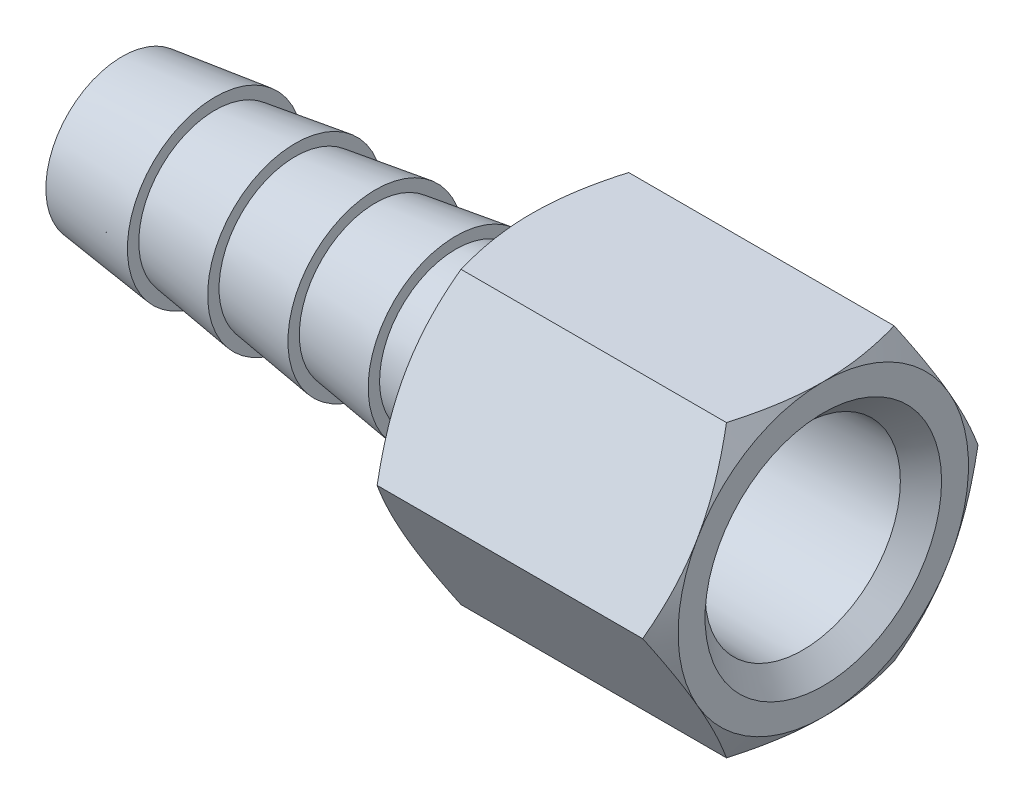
ISO-10303-21;
HEADER;
FILE_DESCRIPTION(('STEP AP214'),'2;1');
FILE_NAME('part.step','',(''),(''),'','','');
FILE_SCHEMA(('AUTOMOTIVE_DESIGN { 1 0 10303 214 1 1 1 1 }'));
ENDSEC;
DATA;
#1=APPLICATION_CONTEXT('core data for automotive mechanical design processes');
#2=APPLICATION_PROTOCOL_DEFINITION('international standard','automotive_design',2000,#1);
#3=PRODUCT_CONTEXT('',#1,'mechanical');
#4=PRODUCT('Part','Part','',(#3));
#5=PRODUCT_RELATED_PRODUCT_CATEGORY('part','',(#4));
#6=PRODUCT_DEFINITION_FORMATION('','',#4);
#7=PRODUCT_DEFINITION_CONTEXT('part definition',#1,'design');
#8=PRODUCT_DEFINITION('design','',#6,#7);
#9=PRODUCT_DEFINITION_SHAPE('','',#8);
#10=(LENGTH_UNIT() NAMED_UNIT(*) SI_UNIT(.MILLI.,.METRE.));
#11=(NAMED_UNIT(*) PLANE_ANGLE_UNIT() SI_UNIT($,.RADIAN.));
#12=(NAMED_UNIT(*) SI_UNIT($,.STERADIAN.) SOLID_ANGLE_UNIT());
#13=UNCERTAINTY_MEASURE_WITH_UNIT(LENGTH_MEASURE(1.E-05),#10,'distance_accuracy_value','');
#14=(GEOMETRIC_REPRESENTATION_CONTEXT(3) GLOBAL_UNCERTAINTY_ASSIGNED_CONTEXT((#13)) GLOBAL_UNIT_ASSIGNED_CONTEXT((#10,
#11,#12)) REPRESENTATION_CONTEXT('',''));
#15=CARTESIAN_POINT('',(0.,0.,0.));
#16=DIRECTION('',(0.,0.,1.));
#17=DIRECTION('',(1.,0.,0.));
#18=AXIS2_PLACEMENT_3D('',#15,#16,#17);
#19=CARTESIAN_POINT('',(24.6379999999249,0.,0.));
#20=DIRECTION('',(1.,0.,0.));
#21=DIRECTION('',(0.,1.,0.));
#22=AXIS2_PLACEMENT_3D('',#19,#20,#21);
#23=CONICAL_SURFACE('',#22,5.27049999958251,0.148889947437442);
#24=CARTESIAN_POINT('',(20.0659999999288,0.,0.));
#25=DIRECTION('',(1.,0.,0.));
#26=DIRECTION('',(0.,1.,0.));
#27=AXIS2_PLACEMENT_3D('',#24,#25,#26);
#28=CIRCLE('',#27,4.58470000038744);
#29=CARTESIAN_POINT('',(20.0659999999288,4.58470000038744,0.));
#30=VERTEX_POINT('',#29);
#31=EDGE_CURVE('E133',#30,#30,#28,.F.);
#32=ORIENTED_EDGE('',*,*,#31,.F.);
#33=EDGE_LOOP('',(#32));
#34=FACE_BOUND('',#33,.T.);
#35=CARTESIAN_POINT('',(24.6380000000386,0.,0.));
#36=DIRECTION('',(1.,0.,0.));
#37=DIRECTION('',(0.,1.,0.));
#38=AXIS2_PLACEMENT_3D('',#35,#36,#37);
#39=CIRCLE('',#38,5.27049999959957);
#40=CARTESIAN_POINT('',(24.6380000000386,5.27049999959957,0.));
#41=VERTEX_POINT('',#40);
#42=EDGE_CURVE('E20',#41,#41,#39,.F.);
#43=ORIENTED_EDGE('',*,*,#42,.T.);
#44=EDGE_LOOP('',(#43));
#45=FACE_BOUND('',#44,.T.);
#46=ADVANCED_FACE('F16',(#34,#45),#23,.T.);
#47=CARTESIAN_POINT('',(24.638,0.,0.));
#48=DIRECTION('',(1.,0.,0.));
#49=DIRECTION('',(0.,0.,-1.));
#50=AXIS2_PLACEMENT_3D('',#47,#48,#49);
#51=PLANE('',#50);
#52=ORIENTED_EDGE('',*,*,#42,.F.);
#53=EDGE_LOOP('',(#52));
#54=FACE_BOUND('',#53,.T.);
#55=CARTESIAN_POINT('',(24.6379999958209,0.,0.));
#56=DIRECTION('',(1.,0.,0.));
#57=DIRECTION('',(0.,0.,-1.));
#58=AXIS2_PLACEMENT_3D('',#55,#56,#57);
#59=CIRCLE('',#58,8.73125000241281);
#60=CARTESIAN_POINT('',(24.6379999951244,4.36562500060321,7.56148430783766));
#61=VERTEX_POINT('',#60);
#62=CARTESIAN_POINT('',(24.6379999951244,-4.3656250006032,7.56148430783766));
#63=VERTEX_POINT('',#62);
#64=EDGE_CURVE('E125',#61,#63,#59,.T.);
#65=ORIENTED_EDGE('',*,*,#64,.F.);
#66=CARTESIAN_POINT('',(24.6379999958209,0.,0.));
#67=DIRECTION('',(1.,0.,0.));
#68=DIRECTION('',(0.,0.,-1.));
#69=AXIS2_PLACEMENT_3D('',#66,#67,#68);
#70=CIRCLE('',#69,8.73125000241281);
#71=CARTESIAN_POINT('',(24.6379999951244,8.73125000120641,0.));
#72=VERTEX_POINT('',#71);
#73=EDGE_CURVE('E103',#72,#61,#70,.T.);
#74=ORIENTED_EDGE('',*,*,#73,.F.);
#75=CARTESIAN_POINT('',(24.6379999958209,0.,0.));
#76=DIRECTION('',(1.,0.,0.));
#77=DIRECTION('',(0.,0.,-1.));
#78=AXIS2_PLACEMENT_3D('',#75,#76,#77);
#79=CIRCLE('',#78,8.73125000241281);
#80=CARTESIAN_POINT('',(24.6379999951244,4.3656250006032,-7.56148430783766));
#81=VERTEX_POINT('',#80);
#82=EDGE_CURVE('E113',#81,#72,#79,.T.);
#83=ORIENTED_EDGE('',*,*,#82,.F.);
#84=CARTESIAN_POINT('',(24.6379999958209,0.,0.));
#85=DIRECTION('',(1.,0.,0.));
#86=DIRECTION('',(0.,0.,-1.));
#87=AXIS2_PLACEMENT_3D('',#84,#85,#86);
#88=CIRCLE('',#87,8.73125000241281);
#89=CARTESIAN_POINT('',(24.6379999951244,-4.3656250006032,-7.56148430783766));
#90=VERTEX_POINT('',#89);
#91=EDGE_CURVE('E469',#90,#81,#88,.T.);
#92=ORIENTED_EDGE('',*,*,#91,.F.);
#93=CARTESIAN_POINT('',(24.6379999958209,0.,0.));
#94=DIRECTION('',(1.,0.,0.));
#95=DIRECTION('',(0.,0.,-1.));
#96=AXIS2_PLACEMENT_3D('',#93,#94,#95);
#97=CIRCLE('',#96,8.73125000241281);
#98=CARTESIAN_POINT('',(24.6379999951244,-8.73125000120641,0.));
#99=VERTEX_POINT('',#98);
#100=EDGE_CURVE('E448',#99,#90,#97,.T.);
#101=ORIENTED_EDGE('',*,*,#100,.F.);
#102=CARTESIAN_POINT('',(24.6379999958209,0.,0.));
#103=DIRECTION('',(1.,0.,0.));
#104=DIRECTION('',(0.,0.,-1.));
#105=AXIS2_PLACEMENT_3D('',#102,#103,#104);
#106=CIRCLE('',#105,8.73125000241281);
#107=EDGE_CURVE('E128',#63,#99,#106,.T.);
#108=ORIENTED_EDGE('',*,*,#107,.F.);
#109=EDGE_LOOP('',(#65,#74,#83,#92,#101,#108));
#110=FACE_BOUND('',#109,.T.);
#111=ADVANCED_FACE('F126',(#54,#110),#51,.F.);
#112=CARTESIAN_POINT('',(20.066,0.,2.63525));
#113=DIRECTION('',(1.,0.,0.));
#114=DIRECTION('',(0.,0.,-1.));
#115=AXIS2_PLACEMENT_3D('',#112,#113,#114);
#116=PLANE('',#115);
#117=ORIENTED_EDGE('',*,*,#31,.T.);
#118=EDGE_LOOP('',(#117));
#119=FACE_BOUND('',#118,.T.);
#120=CARTESIAN_POINT('',(20.0660000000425,0.,0.));
#121=DIRECTION('',(1.,0.,0.));
#122=DIRECTION('',(0.,0.,-1.));
#123=AXIS2_PLACEMENT_3D('',#120,#121,#122);
#124=CIRCLE('',#123,5.27049999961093);
#125=CARTESIAN_POINT('',(20.0660000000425,0.,-5.27049999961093));
#126=VERTEX_POINT('',#125);
#127=EDGE_CURVE('E112',#126,#126,#124,.F.);
#128=ORIENTED_EDGE('',*,*,#127,.F.);
#129=EDGE_LOOP('',(#128));
#130=FACE_BOUND('',#129,.T.);
#131=ADVANCED_FACE('F163',(#119,#130),#116,.T.);
#132=CARTESIAN_POINT('',(25.4225228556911,0.,0.));
#133=DIRECTION('',(1.,0.,0.));
#134=DIRECTION('',(0.,0.,-1.));
#135=AXIS2_PLACEMENT_3D('',#132,#133,#134);
#136=CONICAL_SURFACE('',#135,10.0900834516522,1.04719755);
#137=ORIENTED_EDGE('',*,*,#64,.T.);
#138=CARTESIAN_POINT('',(25.4178437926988,1.0089125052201E-09,10.0819790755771));
#139=CARTESIAN_POINT('',(25.2993607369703,-0.355360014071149,9.87681187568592));
#140=CARTESIAN_POINT('',(25.1908095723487,-0.713565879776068,9.67000162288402));
#141=CARTESIAN_POINT('',(24.9993815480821,-1.43313516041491,9.25455810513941));
#142=CARTESIAN_POINT('',(24.9163777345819,-1.79447347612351,9.04593933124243));
#143=CARTESIAN_POINT('',(24.8144631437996,-2.33989110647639,8.73104231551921));
#144=CARTESIAN_POINT('',(24.784244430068,-2.52238596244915,8.62567886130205));
#145=CARTESIAN_POINT('',(24.7319352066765,-2.88824935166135,8.41444753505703));
#146=CARTESIAN_POINT('',(24.7098444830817,-3.07161786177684,8.30857967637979));
#147=CARTESIAN_POINT('',(24.6741793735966,-3.43990681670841,8.09594794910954));
#148=CARTESIAN_POINT('',(24.6606482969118,-3.62483043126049,7.98918225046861));
#149=CARTESIAN_POINT('',(24.6425398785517,-3.99504134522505,7.77544087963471));
#150=CARTESIAN_POINT('',(24.6379643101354,-4.18032870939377,7.6684651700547));
#151=CARTESIAN_POINT('',(24.6379999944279,-4.36562499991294,7.56148430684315));
#152=B_SPLINE_CURVE_WITH_KNOTS('',3,(#138,#139,#140,#141,#142,#143,#144,#145,#146,#147,#148,
#149,#150,#151),.UNSPECIFIED.,.F.,.F.,(4,2,2,2,2,2,4),(0.,1.2818115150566,2.5571463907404,
3.19565058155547,3.83413796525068,4.47583059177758,5.11765026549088),.UNSPECIFIED.);
#153=CARTESIAN_POINT('',(25.4178437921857,-3.94277984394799E-10,10.0819790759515));
#154=VERTEX_POINT('',#153);
#155=EDGE_CURVE('E136',#154,#63,#152,.T.);
#156=ORIENTED_EDGE('',*,*,#155,.F.);
#157=CARTESIAN_POINT('',(24.6379999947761,4.3656249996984,7.5614843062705));
#158=CARTESIAN_POINT('',(24.6379643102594,4.18032870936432,7.66846516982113));
#159=CARTESIAN_POINT('',(24.6425398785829,3.99504134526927,7.77544087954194));
#160=CARTESIAN_POINT('',(24.6606482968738,3.62483043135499,7.98918225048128));
#161=CARTESIAN_POINT('',(24.6741793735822,3.43990681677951,8.0959479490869));
#162=CARTESIAN_POINT('',(24.7098444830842,3.07161786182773,8.30857967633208));
#163=CARTESIAN_POINT('',(24.7319352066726,2.88824935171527,8.41444753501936));
#164=CARTESIAN_POINT('',(24.7842444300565,2.52238596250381,8.62567886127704));
#165=CARTESIAN_POINT('',(24.8144631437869,2.33989110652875,8.73104231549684));
#166=CARTESIAN_POINT('',(24.9163777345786,1.79447347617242,9.04593933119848));
#167=CARTESIAN_POINT('',(24.9993815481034,1.4331351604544,9.25455810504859));
#168=CARTESIAN_POINT('',(25.1908095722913,0.713565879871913,9.67000162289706));
#169=CARTESIAN_POINT('',(25.2993607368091,0.355360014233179,9.87681187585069));
#170=CARTESIAN_POINT('',(25.4178437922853,-6.93149742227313E-10,10.081979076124));
#171=B_SPLINE_CURVE_WITH_KNOTS('',3,(#157,#158,#159,#160,#161,#162,#163,#164,#165,#166,#167,
#168,#169,#170),.UNSPECIFIED.,.F.,.F.,(4,2,2,2,2,2,4),(0.,0.641819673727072,1.28351230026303,
1.92199968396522,2.56050387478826,3.83583875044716,5.11765026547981),.UNSPECIFIED.);
#172=EDGE_CURVE('E118',#61,#154,#171,.T.);
#173=ORIENTED_EDGE('',*,*,#172,.F.);
#174=EDGE_LOOP('',(#137,#156,#173));
#175=FACE_BOUND('',#174,.T.);
#176=ADVANCED_FACE('F135',(#175),#136,.T.);
#177=CARTESIAN_POINT('',(25.4225228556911,0.,0.));
#178=DIRECTION('',(1.,0.,0.));
#179=DIRECTION('',(0.,0.,-1.));
#180=AXIS2_PLACEMENT_3D('',#177,#178,#179);
#181=CONICAL_SURFACE('',#180,10.0900834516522,1.04719755);
#182=ORIENTED_EDGE('',*,*,#107,.T.);
#183=CARTESIAN_POINT('',(25.4178437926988,-8.73124999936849,5.04098953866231));
#184=CARTESIAN_POINT('',(25.2993607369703,-8.73124999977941,4.63065513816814));
#185=CARTESIAN_POINT('',(25.1908095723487,-8.73124999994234,4.21703463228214));
#186=CARTESIAN_POINT('',(24.9993815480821,-8.73125000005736,3.3861475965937));
#187=CARTESIAN_POINT('',(24.9163777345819,-8.73125000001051,2.96891004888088));
#188=CARTESIAN_POINT('',(24.8144631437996,-8.73124999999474,2.33911601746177));
#189=CARTESIAN_POINT('',(24.784244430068,-8.73124999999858,2.1283891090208));
#190=CARTESIAN_POINT('',(24.7319352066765,-8.73125000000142,1.70592645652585));
#191=CARTESIAN_POINT('',(24.7098444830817,-8.73125000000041,1.4941907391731));
#192=CARTESIAN_POINT('',(24.6741793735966,-8.73124999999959,1.06892728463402));
#193=CARTESIAN_POINT('',(24.6606482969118,-8.7312499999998,0.855395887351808));
#194=CARTESIAN_POINT('',(24.6425398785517,-8.7312500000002,0.427913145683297));
#195=CARTESIAN_POINT('',(24.6379643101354,-8.73125000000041,0.213961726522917));
#196=CARTESIAN_POINT('',(24.6379999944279,-8.73125,1.00530632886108E-10));
#197=B_SPLINE_CURVE_WITH_KNOTS('',3,(#183,#184,#185,#186,#187,#188,#189,#190,#191,#192,#193,
#194,#195,#196),.UNSPECIFIED.,.F.,.F.,(4,2,2,2,2,2,4),(0.,1.2818115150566,2.5571463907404,
3.19565058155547,3.83413796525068,4.47583059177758,5.11765026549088),.UNSPECIFIED.);
#198=CARTESIAN_POINT('',(25.4178437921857,-8.73125000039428,5.04098953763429));
#199=VERTEX_POINT('',#198);
#200=EDGE_CURVE('E242',#199,#99,#197,.T.);
#201=ORIENTED_EDGE('',*,*,#200,.F.);
#202=CARTESIAN_POINT('',(24.6379999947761,-4.3656249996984,7.5614843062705));
#203=CARTESIAN_POINT('',(24.6379643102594,-4.55092129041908,7.45450344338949));
#204=CARTESIAN_POINT('',(24.6425398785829,-4.73620865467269,7.34752773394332));
#205=CARTESIAN_POINT('',(24.6606482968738,-5.10641956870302,7.13378636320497));
#206=CARTESIAN_POINT('',(24.6741793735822,-5.29134318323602,7.02702066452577));
#207=CARTESIAN_POINT('',(24.7098444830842,-5.6596321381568,6.8143889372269));
#208=CARTESIAN_POINT('',(24.7319352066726,-5.84300064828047,6.70852107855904));
#209=CARTESIAN_POINT('',(24.7842444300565,-6.20886403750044,6.49728975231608));
#210=CARTESIAN_POINT('',(24.8144631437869,-6.39135889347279,6.3919262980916));
#211=CARTESIAN_POINT('',(24.9163777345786,-6.93677652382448,6.07702928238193));
#212=CARTESIAN_POINT('',(24.9993815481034,-7.29811483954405,5.86841050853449));
#213=CARTESIAN_POINT('',(25.1908095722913,-8.01768412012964,5.4529669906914));
#214=CARTESIAN_POINT('',(25.2993607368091,-8.37588998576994,5.24615673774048));
#215=CARTESIAN_POINT('',(25.4178437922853,-8.73125000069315,5.04098953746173));
#216=B_SPLINE_CURVE_WITH_KNOTS('',3,(#202,#203,#204,#205,#206,#207,#208,#209,#210,#211,#212,
#213,#214,#215),.UNSPECIFIED.,.F.,.F.,(4,2,2,2,2,2,4),(0.,0.641819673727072,1.28351230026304,
1.92199968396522,2.56050387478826,3.83583875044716,5.11765026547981),.UNSPECIFIED.);
#217=EDGE_CURVE('E243',#63,#199,#216,.T.);
#218=ORIENTED_EDGE('',*,*,#217,.F.);
#219=EDGE_LOOP('',(#182,#201,#218));
#220=FACE_BOUND('',#219,.T.);
#221=ADVANCED_FACE('F162',(#220),#181,.T.);
#222=CARTESIAN_POINT('',(25.4225228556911,0.,0.));
#223=DIRECTION('',(1.,0.,0.));
#224=DIRECTION('',(0.,0.,-1.));
#225=AXIS2_PLACEMENT_3D('',#222,#223,#224);
#226=CONICAL_SURFACE('',#225,10.0900834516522,1.04719755);
#227=CARTESIAN_POINT('',(24.6379999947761,-8.7312499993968,0.));
#228=CARTESIAN_POINT('',(24.6379643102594,-8.73124999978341,-0.213961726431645));
#229=CARTESIAN_POINT('',(24.6425398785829,-8.73124999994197,-0.427913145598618));
#230=CARTESIAN_POINT('',(24.6606482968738,-8.73125000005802,-0.855395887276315));
#231=CARTESIAN_POINT('',(24.6741793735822,-8.73125000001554,-1.06892728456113));
#232=CARTESIAN_POINT('',(24.7098444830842,-8.73124999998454,-1.49419073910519));
#233=CARTESIAN_POINT('',(24.7319352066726,-8.73124999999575,-1.70592645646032));
#234=CARTESIAN_POINT('',(24.7842444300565,-8.73125000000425,-2.12838910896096));
#235=CARTESIAN_POINT('',(24.8144631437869,-8.73125000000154,-2.33911601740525));
#236=CARTESIAN_POINT('',(24.9163777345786,-8.73124999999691,-2.96891004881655));
#237=CARTESIAN_POINT('',(24.9993815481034,-8.73124999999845,-3.3861475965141));
#238=CARTESIAN_POINT('',(25.1908095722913,-8.73125000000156,-4.21703463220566));
#239=CARTESIAN_POINT('',(25.2993607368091,-8.73125000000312,-4.63065513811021));
#240=CARTESIAN_POINT('',(25.4178437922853,-8.73125,-5.04098953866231));
#241=B_SPLINE_CURVE_WITH_KNOTS('',3,(#227,#228,#229,#230,#231,#232,#233,#234,#235,#236,#237,
#238,#239,#240),.UNSPECIFIED.,.F.,.F.,(4,2,2,2,2,2,4),(0.,0.641819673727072,1.28351230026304,
1.92199968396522,2.56050387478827,3.83583875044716,5.11765026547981),.UNSPECIFIED.);
#242=CARTESIAN_POINT('',(25.4178437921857,-8.73125,-5.0409895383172));
#243=VERTEX_POINT('',#242);
#244=EDGE_CURVE('E239',#99,#243,#241,.T.);
#245=ORIENTED_EDGE('',*,*,#244,.F.);
#246=ORIENTED_EDGE('',*,*,#100,.T.);
#247=CARTESIAN_POINT('',(25.4178437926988,-8.7312500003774,-5.04098953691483));
#248=CARTESIAN_POINT('',(25.2993607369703,-8.37588998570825,-5.24615673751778));
#249=CARTESIAN_POINT('',(25.1908095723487,-8.01768412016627,-5.45296699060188));
#250=CARTESIAN_POINT('',(24.9993815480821,-7.29811483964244,-5.86841050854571));
#251=CARTESIAN_POINT('',(24.9163777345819,-6.936776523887,-6.07702928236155));
#252=CARTESIAN_POINT('',(24.8144631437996,-6.39135889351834,-6.39192629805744));
#253=CARTESIAN_POINT('',(24.784244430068,-6.20886403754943,-6.49728975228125));
#254=CARTESIAN_POINT('',(24.7319352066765,-5.84300064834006,-6.70852107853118));
#255=CARTESIAN_POINT('',(24.7098444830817,-5.65963213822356,-6.81438893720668));
#256=CARTESIAN_POINT('',(24.6741793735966,-5.29134318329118,-7.02702066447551));
#257=CARTESIAN_POINT('',(24.6606482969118,-5.10641956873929,-7.1337863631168));
#258=CARTESIAN_POINT('',(24.6425398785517,-4.73620865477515,-7.34752773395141));
#259=CARTESIAN_POINT('',(24.6379643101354,-4.55092129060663,-7.45450344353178));
#260=CARTESIAN_POINT('',(24.6379999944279,-4.36562500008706,-7.56148430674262));
#261=B_SPLINE_CURVE_WITH_KNOTS('',3,(#247,#248,#249,#250,#251,#252,#253,#254,#255,#256,#257,
#258,#259,#260),.UNSPECIFIED.,.F.,.F.,(4,2,2,2,2,2,4),(0.,1.2818115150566,2.55714639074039,
3.19565058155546,3.83413796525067,4.47583059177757,5.11765026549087),.UNSPECIFIED.);
#262=EDGE_CURVE('E238',#243,#90,#261,.T.);
#263=ORIENTED_EDGE('',*,*,#262,.F.);
#264=EDGE_LOOP('',(#245,#246,#263));
#265=FACE_BOUND('',#264,.T.);
#266=ADVANCED_FACE('F434',(#265),#226,.T.);
#267=CARTESIAN_POINT('',(25.4225228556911,0.,0.));
#268=DIRECTION('',(1.,0.,0.));
#269=DIRECTION('',(0.,0.,-1.));
#270=AXIS2_PLACEMENT_3D('',#267,#268,#269);
#271=CONICAL_SURFACE('',#270,10.0900834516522,1.04719755);
#272=CARTESIAN_POINT('',(24.6379999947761,-4.3656249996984,-7.5614843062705));
#273=CARTESIAN_POINT('',(24.6379643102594,-4.18032870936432,-7.66846516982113));
#274=CARTESIAN_POINT('',(24.6425398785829,-3.99504134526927,-7.77544087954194));
#275=CARTESIAN_POINT('',(24.6606482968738,-3.62483043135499,-7.98918225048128));
#276=CARTESIAN_POINT('',(24.6741793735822,-3.43990681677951,-8.0959479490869));
#277=CARTESIAN_POINT('',(24.7098444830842,-3.07161786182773,-8.30857967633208));
#278=CARTESIAN_POINT('',(24.7319352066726,-2.88824935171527,-8.41444753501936));
#279=CARTESIAN_POINT('',(24.7842444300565,-2.5223859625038,-8.62567886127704));
#280=CARTESIAN_POINT('',(24.8144631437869,-2.33989110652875,-8.73104231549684));
#281=CARTESIAN_POINT('',(24.9163777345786,-1.79447347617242,-9.04593933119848));
#282=CARTESIAN_POINT('',(24.9993815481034,-1.4331351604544,-9.25455810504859));
#283=CARTESIAN_POINT('',(25.1908095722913,-0.713565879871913,-9.67000162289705));
#284=CARTESIAN_POINT('',(25.2993607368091,-0.355360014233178,-9.87681187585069));
#285=CARTESIAN_POINT('',(25.4178437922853,6.93150288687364E-10,-10.081979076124));
#286=B_SPLINE_CURVE_WITH_KNOTS('',3,(#272,#273,#274,#275,#276,#277,#278,#279,#280,#281,#282,
#283,#284,#285),.UNSPECIFIED.,.F.,.F.,(4,2,2,2,2,2,4),(0.,0.641819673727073,1.28351230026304,
1.92199968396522,2.56050387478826,3.83583875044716,5.11765026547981),.UNSPECIFIED.);
#287=CARTESIAN_POINT('',(25.4178437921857,3.94281174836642E-10,-10.0819790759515));
#288=VERTEX_POINT('',#287);
#289=EDGE_CURVE('E234',#90,#288,#286,.T.);
#290=ORIENTED_EDGE('',*,*,#289,.F.);
#291=ORIENTED_EDGE('',*,*,#91,.T.);
#292=CARTESIAN_POINT('',(25.4178437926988,-1.00890624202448E-09,-10.0819790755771));
#293=CARTESIAN_POINT('',(25.2993607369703,0.355360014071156,-9.87681187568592));
#294=CARTESIAN_POINT('',(25.1908095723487,0.713565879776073,-9.67000162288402));
#295=CARTESIAN_POINT('',(24.9993815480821,1.43313516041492,-9.25455810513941));
#296=CARTESIAN_POINT('',(24.9163777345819,1.79447347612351,-9.04593933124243));
#297=CARTESIAN_POINT('',(24.8144631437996,2.33989110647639,-8.73104231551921));
#298=CARTESIAN_POINT('',(24.784244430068,2.52238596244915,-8.62567886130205));
#299=CARTESIAN_POINT('',(24.7319352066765,2.88824935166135,-8.41444753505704));
#300=CARTESIAN_POINT('',(24.7098444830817,3.07161786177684,-8.30857967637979));
#301=CARTESIAN_POINT('',(24.6741793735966,3.43990681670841,-8.09594794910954));
#302=CARTESIAN_POINT('',(24.6606482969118,3.6248304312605,-7.98918225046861));
#303=CARTESIAN_POINT('',(24.6425398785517,3.99504134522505,-7.77544087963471));
#304=CARTESIAN_POINT('',(24.6379643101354,4.18032870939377,-7.66846517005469));
#305=CARTESIAN_POINT('',(24.6379999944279,4.36562499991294,-7.56148430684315));
#306=B_SPLINE_CURVE_WITH_KNOTS('',3,(#292,#293,#294,#295,#296,#297,#298,#299,#300,#301,#302,
#303,#304,#305),.UNSPECIFIED.,.F.,.F.,(4,2,2,2,2,2,4),(0.,1.2818115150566,2.55714639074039,
3.19565058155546,3.83413796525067,4.47583059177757,5.11765026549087),.UNSPECIFIED.);
#307=EDGE_CURVE('E233',#288,#81,#306,.T.);
#308=ORIENTED_EDGE('',*,*,#307,.F.);
#309=EDGE_LOOP('',(#290,#291,#308));
#310=FACE_BOUND('',#309,.T.);
#311=ADVANCED_FACE('F333',(#310),#271,.T.);
#312=CARTESIAN_POINT('',(25.4225228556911,0.,0.));
#313=DIRECTION('',(1.,0.,0.));
#314=DIRECTION('',(0.,0.,-1.));
#315=AXIS2_PLACEMENT_3D('',#312,#313,#314);
#316=CONICAL_SURFACE('',#315,10.0900834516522,1.04719755);
#317=CARTESIAN_POINT('',(24.6379999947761,4.3656249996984,-7.5614843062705));
#318=CARTESIAN_POINT('',(24.6379643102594,4.55092129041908,-7.45450344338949));
#319=CARTESIAN_POINT('',(24.6425398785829,4.73620865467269,-7.34752773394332));
#320=CARTESIAN_POINT('',(24.6606482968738,5.10641956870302,-7.13378636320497));
#321=CARTESIAN_POINT('',(24.6741793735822,5.29134318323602,-7.02702066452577));
#322=CARTESIAN_POINT('',(24.7098444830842,5.6596321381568,-6.8143889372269));
#323=CARTESIAN_POINT('',(24.7319352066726,5.84300064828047,-6.70852107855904));
#324=CARTESIAN_POINT('',(24.7842444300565,6.20886403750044,-6.49728975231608));
#325=CARTESIAN_POINT('',(24.8144631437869,6.39135889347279,-6.3919262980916));
#326=CARTESIAN_POINT('',(24.9163777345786,6.93677652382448,-6.07702928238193));
#327=CARTESIAN_POINT('',(24.9993815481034,7.29811483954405,-5.86841050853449));
#328=CARTESIAN_POINT('',(25.1908095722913,8.01768412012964,-5.4529669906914));
#329=CARTESIAN_POINT('',(25.2993607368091,8.37588998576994,-5.24615673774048));
#330=CARTESIAN_POINT('',(25.4178437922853,8.73125000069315,-5.04098953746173));
#331=B_SPLINE_CURVE_WITH_KNOTS('',3,(#317,#318,#319,#320,#321,#322,#323,#324,#325,#326,#327,
#328,#329,#330),.UNSPECIFIED.,.F.,.F.,(4,2,2,2,2,2,4),(0.,0.641819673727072,1.28351230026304,
1.92199968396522,2.56050387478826,3.83583875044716,5.11765026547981),.UNSPECIFIED.);
#332=CARTESIAN_POINT('',(25.4178437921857,8.73125000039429,-5.04098953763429));
#333=VERTEX_POINT('',#332);
#334=EDGE_CURVE('E229',#81,#333,#331,.T.);
#335=ORIENTED_EDGE('',*,*,#334,.F.);
#336=ORIENTED_EDGE('',*,*,#82,.T.);
#337=CARTESIAN_POINT('',(25.4178437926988,8.73124999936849,-5.04098953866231));
#338=CARTESIAN_POINT('',(25.2993607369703,8.73124999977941,-4.63065513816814));
#339=CARTESIAN_POINT('',(25.1908095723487,8.73124999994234,-4.21703463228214));
#340=CARTESIAN_POINT('',(24.9993815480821,8.73125000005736,-3.3861475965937));
#341=CARTESIAN_POINT('',(24.9163777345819,8.73125000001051,-2.96891004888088));
#342=CARTESIAN_POINT('',(24.8144631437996,8.73124999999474,-2.33911601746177));
#343=CARTESIAN_POINT('',(24.784244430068,8.73124999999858,-2.1283891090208));
#344=CARTESIAN_POINT('',(24.7319352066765,8.73125000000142,-1.70592645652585));
#345=CARTESIAN_POINT('',(24.7098444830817,8.73125000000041,-1.49419073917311));
#346=CARTESIAN_POINT('',(24.6741793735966,8.73124999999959,-1.06892728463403));
#347=CARTESIAN_POINT('',(24.6606482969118,8.7312499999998,-0.855395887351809));
#348=CARTESIAN_POINT('',(24.6425398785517,8.7312500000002,-0.427913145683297));
#349=CARTESIAN_POINT('',(24.6379643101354,8.73125000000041,-0.213961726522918));
#350=CARTESIAN_POINT('',(24.6379999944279,8.73125,-1.00531554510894E-10));
#351=B_SPLINE_CURVE_WITH_KNOTS('',3,(#337,#338,#339,#340,#341,#342,#343,#344,#345,#346,#347,
#348,#349,#350),.UNSPECIFIED.,.F.,.F.,(4,2,2,2,2,2,4),(0.,1.2818115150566,2.5571463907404,
3.19565058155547,3.83413796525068,4.47583059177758,5.11765026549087),.UNSPECIFIED.);
#352=EDGE_CURVE('E228',#333,#72,#351,.T.);
#353=ORIENTED_EDGE('',*,*,#352,.F.);
#354=EDGE_LOOP('',(#335,#336,#353));
#355=FACE_BOUND('',#354,.T.);
#356=ADVANCED_FACE('F328',(#355),#316,.T.);
#357=CARTESIAN_POINT('',(25.4225228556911,0.,0.));
#358=DIRECTION('',(1.,0.,0.));
#359=DIRECTION('',(0.,0.,-1.));
#360=AXIS2_PLACEMENT_3D('',#357,#358,#359);
#361=CONICAL_SURFACE('',#360,10.0900834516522,1.04719755);
#362=ORIENTED_EDGE('',*,*,#73,.T.);
#363=CARTESIAN_POINT('',(25.4178437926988,8.7312500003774,5.04098953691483));
#364=CARTESIAN_POINT('',(25.2993607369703,8.37588998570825,5.24615673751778));
#365=CARTESIAN_POINT('',(25.1908095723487,8.01768412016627,5.45296699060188));
#366=CARTESIAN_POINT('',(24.9993815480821,7.29811483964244,5.86841050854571));
#367=CARTESIAN_POINT('',(24.9163777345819,6.936776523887,6.07702928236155));
#368=CARTESIAN_POINT('',(24.8144631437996,6.39135889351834,6.39192629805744));
#369=CARTESIAN_POINT('',(24.784244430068,6.20886403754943,6.49728975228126));
#370=CARTESIAN_POINT('',(24.7319352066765,5.84300064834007,6.70852107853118));
#371=CARTESIAN_POINT('',(24.7098444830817,5.65963213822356,6.81438893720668));
#372=CARTESIAN_POINT('',(24.6741793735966,5.29134318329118,7.02702066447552));
#373=CARTESIAN_POINT('',(24.6606482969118,5.10641956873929,7.1337863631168));
#374=CARTESIAN_POINT('',(24.6425398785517,4.73620865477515,7.34752773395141));
#375=CARTESIAN_POINT('',(24.6379643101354,4.55092129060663,7.45450344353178));
#376=CARTESIAN_POINT('',(24.6379999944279,4.36562500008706,7.56148430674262));
#377=B_SPLINE_CURVE_WITH_KNOTS('',3,(#363,#364,#365,#366,#367,#368,#369,#370,#371,#372,#373,
#374,#375,#376),.UNSPECIFIED.,.F.,.F.,(4,2,2,2,2,2,4),(0.,1.2818115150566,2.55714639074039,
3.19565058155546,3.83413796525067,4.47583059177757,5.11765026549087),.UNSPECIFIED.);
#378=CARTESIAN_POINT('',(25.4178437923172,8.73125000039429,5.04098953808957));
#379=VERTEX_POINT('',#378);
#380=EDGE_CURVE('E106',#379,#61,#377,.T.);
#381=ORIENTED_EDGE('',*,*,#380,.F.);
#382=CARTESIAN_POINT('',(24.6379999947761,8.7312499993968,0.));
#383=CARTESIAN_POINT('',(24.6379643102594,8.73124999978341,0.213961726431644));
#384=CARTESIAN_POINT('',(24.6425398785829,8.73124999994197,0.427913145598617));
#385=CARTESIAN_POINT('',(24.6606482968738,8.73125000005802,0.855395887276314));
#386=CARTESIAN_POINT('',(24.6741793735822,8.73125000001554,1.06892728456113));
#387=CARTESIAN_POINT('',(24.7098444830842,8.73124999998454,1.49419073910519));
#388=CARTESIAN_POINT('',(24.7319352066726,8.73124999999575,1.70592645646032));
#389=CARTESIAN_POINT('',(24.7842444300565,8.73125000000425,2.12838910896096));
#390=CARTESIAN_POINT('',(24.8144631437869,8.73125000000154,2.33911601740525));
#391=CARTESIAN_POINT('',(24.9163777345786,8.73124999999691,2.96891004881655));
#392=CARTESIAN_POINT('',(24.9993815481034,8.73124999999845,3.3861475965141));
#393=CARTESIAN_POINT('',(25.1908095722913,8.73125000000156,4.21703463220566));
#394=CARTESIAN_POINT('',(25.2993607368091,8.73125000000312,4.63065513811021));
#395=CARTESIAN_POINT('',(25.4178437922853,8.73125,5.04098953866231));
#396=B_SPLINE_CURVE_WITH_KNOTS('',3,(#382,#383,#384,#385,#386,#387,#388,#389,#390,#391,#392,
#393,#394,#395),.UNSPECIFIED.,.F.,.F.,(4,2,2,2,2,2,4),(0.,0.641819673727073,1.28351230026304,
1.92199968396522,2.56050387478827,3.83583875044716,5.11765026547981),.UNSPECIFIED.);
#397=EDGE_CURVE('E108',#72,#379,#396,.T.);
#398=ORIENTED_EDGE('',*,*,#397,.F.);
#399=EDGE_LOOP('',(#362,#381,#398));
#400=FACE_BOUND('',#399,.T.);
#401=ADVANCED_FACE('F105',(#400),#361,.T.);
#402=CARTESIAN_POINT('',(20.0660000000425,0.,0.));
#403=DIRECTION('',(1.,0.,0.));
#404=DIRECTION('',(0.,0.,-1.));
#405=AXIS2_PLACEMENT_3D('',#402,#403,#404);
#406=CONICAL_SURFACE('',#405,5.27049999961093,0.141160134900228);
#407=CARTESIAN_POINT('',(15.2399999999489,0.,0.));
#408=DIRECTION('',(1.,0.,0.));
#409=DIRECTION('',(0.,0.,-1.));
#410=AXIS2_PLACEMENT_3D('',#407,#408,#409);
#411=CIRCLE('',#410,4.58470000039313);
#412=CARTESIAN_POINT('',(15.2399999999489,0.,-4.58470000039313));
#413=VERTEX_POINT('',#412);
#414=EDGE_CURVE('E224',#413,#413,#411,.F.);
#415=ORIENTED_EDGE('',*,*,#414,.F.);
#416=EDGE_LOOP('',(#415));
#417=FACE_BOUND('',#416,.T.);
#418=ORIENTED_EDGE('',*,*,#127,.T.);
#419=EDGE_LOOP('',(#418));
#420=FACE_BOUND('',#419,.T.);
#421=ADVANCED_FACE('F327',(#417,#420),#406,.T.);
#422=CARTESIAN_POINT('',(24.638,0.,10.0819790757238));
#423=DIRECTION('',(0.,0.5,0.866025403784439));
#424=DIRECTION('',(0.,-0.866025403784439,0.5));
#425=AXIS2_PLACEMENT_3D('',#422,#423,#424);
#426=PLANE('',#425);
#427=ORIENTED_EDGE('',*,*,#172,.T.);
#428=DIRECTION('',(1.,0.,0.));
#429=VECTOR('',#428,1.);
#430=CARTESIAN_POINT('',(24.638,0.,10.0819790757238));
#431=LINE('',#430,#429);
#432=CARTESIAN_POINT('',(41.3841562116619,1.1148569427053E-08,10.0819790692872));
#433=VERTEX_POINT('',#432);
#434=EDGE_CURVE('E137',#433,#154,#431,.F.);
#435=ORIENTED_EDGE('',*,*,#434,.F.);
#436=CARTESIAN_POINT('',(42.1640000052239,4.36562499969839,7.5614843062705));
#437=CARTESIAN_POINT('',(42.1640356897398,4.18032871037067,7.66846516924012));
#438=CARTESIAN_POINT('',(42.1594601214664,3.99504134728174,7.77544087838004));
#439=CARTESIAN_POINT('',(42.1413517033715,3.62483043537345,7.98918224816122));
#440=CARTESIAN_POINT('',(42.1278206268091,3.43990682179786,8.09594794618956));
#441=CARTESIAN_POINT('',(42.0921555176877,3.07161786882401,8.30857967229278));
#442=CARTESIAN_POINT('',(42.0700647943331,2.88824935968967,8.41444753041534));
#443=CARTESIAN_POINT('',(42.017755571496,2.52238597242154,8.62567885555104));
#444=CARTESIAN_POINT('',(41.9875368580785,2.33989111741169,8.73104230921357));
#445=CARTESIAN_POINT('',(41.8856222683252,1.79447348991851,9.04593932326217));
#446=CARTESIAN_POINT('',(41.8026184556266,1.43313517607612,9.25455809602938));
#447=CARTESIAN_POINT('',(41.6111904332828,0.713565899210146,9.67000161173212));
#448=CARTESIAN_POINT('',(41.5026392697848,0.355360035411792,9.87681186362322));
#449=CARTESIAN_POINT('',(41.3841562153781,2.22971345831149E-08,10.0819790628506));
#450=B_SPLINE_CURVE_WITH_KNOTS('',3,(#436,#437,#438,#439,#440,#441,#442,#443,#444,#445,#446,
#447,#448,#449),.UNSPECIFIED.,.F.,.F.,(4,2,2,2,2,2,4),(0.,0.641819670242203,1.28351229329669,
1.92199967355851,2.5605038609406,3.83583872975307,5.11765023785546),.UNSPECIFIED.);
#451=CARTESIAN_POINT('',(42.1640000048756,4.36562500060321,7.56148430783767));
#452=VERTEX_POINT('',#451);
#453=EDGE_CURVE('E407',#452,#433,#450,.T.);
#454=ORIENTED_EDGE('',*,*,#453,.F.);
#455=CARTESIAN_POINT('',(41.3841562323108,8.73124992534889,5.04098958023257));
#456=CARTESIAN_POINT('',(41.5026392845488,8.3758899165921,5.24615677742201));
#457=CARTESIAN_POINT('',(41.6111904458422,8.01768405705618,5.45296702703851));
#458=CARTESIAN_POINT('',(41.8026184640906,7.29811478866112,5.86841053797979));
#459=CARTESIAN_POINT('',(41.8856222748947,6.9367764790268,6.07702930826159));
#460=CARTESIAN_POINT('',(41.9875368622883,6.39135885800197,6.39192631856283));
#461=CARTESIAN_POINT('',(42.0177555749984,6.20886400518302,6.49728977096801));
#462=CARTESIAN_POINT('',(42.0700647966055,5.84300062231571,6.70852109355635));
#463=CARTESIAN_POINT('',(42.0921555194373,5.65963211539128,6.8143889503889));
#464=CARTESIAN_POINT('',(42.1278206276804,5.29134316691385,7.02702067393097));
#465=CARTESIAN_POINT('',(42.141351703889,5.10641955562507,7.1337863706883));
#466=CARTESIAN_POINT('',(42.1594601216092,4.73620864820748,7.34752773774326));
#467=CARTESIAN_POINT('',(42.1640356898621,4.55092128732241,7.45450344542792));
#468=CARTESIAN_POINT('',(42.1640000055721,4.36562500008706,7.56148430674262));
#469=B_SPLINE_CURVE_WITH_KNOTS('',3,(#455,#456,#457,#458,#459,#460,#461,#462,#463,#464,#465,
#466,#467,#468),.UNSPECIFIED.,.F.,.F.,(4,2,2,2,2,2,4),(0.,1.28181149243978,2.55714634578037,
3.19565052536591,3.83413789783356,4.4758305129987,5.11765017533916),.UNSPECIFIED.);
#470=CARTESIAN_POINT('',(41.3841562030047,8.73125,5.04098955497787));
#471=VERTEX_POINT('',#470);
#472=EDGE_CURVE('E732',#471,#452,#469,.T.);
#473=ORIENTED_EDGE('',*,*,#472,.F.);
#474=DIRECTION('',(1.,0.,0.));
#475=VECTOR('',#474,1.);
#476=CARTESIAN_POINT('',(24.638,8.73125,5.04098953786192));
#477=LINE('',#476,#475);
#478=EDGE_CURVE('E121',#379,#471,#477,.T.);
#479=ORIENTED_EDGE('',*,*,#478,.F.);
#480=ORIENTED_EDGE('',*,*,#380,.T.);
#481=EDGE_LOOP('',(#427,#435,#454,#473,#479,#480));
#482=FACE_BOUND('',#481,.T.);
#483=ADVANCED_FACE('F116',(#482),#426,.T.);
#484=CARTESIAN_POINT('',(24.638,-8.73125,5.04098953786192));
#485=DIRECTION('',(0.,-0.5,0.866025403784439));
#486=DIRECTION('',(0.,-0.866025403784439,-0.5));
#487=AXIS2_PLACEMENT_3D('',#484,#485,#486);
#488=PLANE('',#487);
#489=ORIENTED_EDGE('',*,*,#217,.T.);
#490=DIRECTION('',(1.,0.,0.));
#491=VECTOR('',#490,1.);
#492=CARTESIAN_POINT('',(24.638,-8.73125,5.04098953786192));
#493=LINE('',#492,#491);
#494=CARTESIAN_POINT('',(41.3841562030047,-8.73125001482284,5.04098952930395));
#495=VERTEX_POINT('',#494);
#496=EDGE_CURVE('E240',#495,#199,#493,.F.);
#497=ORIENTED_EDGE('',*,*,#496,.F.);
#498=CARTESIAN_POINT('',(42.1640000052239,-4.36562499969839,7.56148430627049));
#499=CARTESIAN_POINT('',(42.1640356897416,-4.55092129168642,7.45450344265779));
#500=CARTESIAN_POINT('',(42.159460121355,-4.73620865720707,7.34752773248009));
#501=CARTESIAN_POINT('',(42.1413517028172,-5.10641957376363,7.13378636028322));
#502=CARTESIAN_POINT('',(42.1278206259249,-5.29134318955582,7.02702066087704));
#503=CARTESIAN_POINT('',(42.0921555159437,-5.65963214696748,6.81438893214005));
#504=CARTESIAN_POINT('',(42.0700647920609,-5.84300065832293,6.70852107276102));
#505=CARTESIAN_POINT('',(42.0177555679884,-6.20886404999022,6.49728974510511));
#506=CARTESIAN_POINT('',(41.9875368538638,-6.3913589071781,6.39192629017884));
#507=CARTESIAN_POINT('',(41.8856222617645,-6.93677654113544,6.07702927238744));
#508=CARTESIAN_POINT('',(41.8026184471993,-7.29811485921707,5.86841049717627));
#509=CARTESIAN_POINT('',(41.6111904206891,-8.017684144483,5.45296697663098));
#510=CARTESIAN_POINT('',(41.5026392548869,-8.37589001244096,5.24615672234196));
#511=CARTESIAN_POINT('',(41.3841561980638,-8.73125002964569,5.04098952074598));
#512=B_SPLINE_CURVE_WITH_KNOTS('',3,(#498,#499,#500,#501,#502,#503,#504,#505,#506,#507,#508,
#509,#510,#511),.UNSPECIFIED.,.F.,.F.,(4,2,2,2,2,2,4),(0.,0.641819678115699,1.28351230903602,
1.92199969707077,2.56050389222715,3.83583877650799,5.11765030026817),.UNSPECIFIED.);
#513=CARTESIAN_POINT('',(42.1640000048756,-4.36562500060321,7.56148430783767));
#514=VERTEX_POINT('',#513);
#515=EDGE_CURVE('E397',#514,#495,#512,.T.);
#516=ORIENTED_EDGE('',*,*,#515,.F.);
#517=CARTESIAN_POINT('',(41.3841562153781,-2.22971285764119E-08,10.0819790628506));
#518=CARTESIAN_POINT('',(41.5026392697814,-0.355360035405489,9.87681186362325));
#519=CARTESIAN_POINT('',(41.611190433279,-0.713565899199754,9.67000161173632));
#520=CARTESIAN_POINT('',(41.8026184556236,-1.433135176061,9.25455809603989));
#521=CARTESIAN_POINT('',(41.8856222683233,-1.7944734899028,9.04593932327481));
#522=CARTESIAN_POINT('',(41.9875368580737,-2.33989111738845,8.7310423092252));
#523=CARTESIAN_POINT('',(42.0177555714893,-2.52238597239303,8.62567885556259));
#524=CARTESIAN_POINT('',(42.0700647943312,-2.88824935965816,8.41444753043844));
#525=CARTESIAN_POINT('',(42.0921555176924,-3.07161786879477,8.30857967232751));
#526=CARTESIAN_POINT('',(42.1278206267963,-3.43990682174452,8.09594794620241));
#527=CARTESIAN_POINT('',(42.1413517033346,-3.6248304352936,7.98918224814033));
#528=CARTESIAN_POINT('',(42.1594601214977,-3.99504134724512,7.77544087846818));
#529=CARTESIAN_POINT('',(42.1640356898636,-4.18032871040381,7.66846516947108));
#530=CARTESIAN_POINT('',(42.1640000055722,-4.36562499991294,7.56148430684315));
#531=B_SPLINE_CURVE_WITH_KNOTS('',3,(#517,#518,#519,#520,#521,#522,#523,#524,#525,#526,#527,
#528,#529,#530),.UNSPECIFIED.,.F.,.F.,(4,2,2,2,2,2,4),(0.,1.28181150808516,2.55714637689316,
3.19565056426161,3.83413794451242,4.4758305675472,5.11765023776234),.UNSPECIFIED.);
#532=EDGE_CURVE('E412',#433,#514,#531,.T.);
#533=ORIENTED_EDGE('',*,*,#532,.F.);
#534=ORIENTED_EDGE('',*,*,#434,.T.);
#535=ORIENTED_EDGE('',*,*,#155,.T.);
#536=EDGE_LOOP('',(#489,#497,#516,#533,#534,#535));
#537=FACE_BOUND('',#536,.T.);
#538=ADVANCED_FACE('F416',(#537),#488,.T.);
#539=CARTESIAN_POINT('',(24.638,-8.73125,-5.04098953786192));
#540=DIRECTION('',(0.,-1.,0.));
#541=DIRECTION('',(0.,0.,-1.));
#542=AXIS2_PLACEMENT_3D('',#539,#540,#541);
#543=PLANE('',#542);
#544=ORIENTED_EDGE('',*,*,#244,.T.);
#545=DIRECTION('',(1.,0.,0.));
#546=VECTOR('',#545,1.);
#547=CARTESIAN_POINT('',(24.638,-8.73125,-5.04098953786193));
#548=LINE('',#547,#546);
#549=CARTESIAN_POINT('',(41.3841562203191,-8.73125,-5.04098949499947));
#550=VERTEX_POINT('',#549);
#551=EDGE_CURVE('E235',#550,#243,#548,.F.);
#552=ORIENTED_EDGE('',*,*,#551,.F.);
#553=CARTESIAN_POINT('',(42.1640000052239,-8.7312499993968,0.));
#554=CARTESIAN_POINT('',(42.1640356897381,-8.73124999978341,-0.213961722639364));
#555=CARTESIAN_POINT('',(42.159460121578,-8.73124999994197,-0.427913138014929));
#556=CARTESIAN_POINT('',(42.141351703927,-8.73125000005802,-0.855395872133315));
#557=CARTESIAN_POINT('',(42.1278206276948,-8.73125000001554,-1.06892726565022));
#558=CARTESIAN_POINT('',(42.0921555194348,-8.73124999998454,-1.49419071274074));
#559=CARTESIAN_POINT('',(42.0700647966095,-8.73124999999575,-1.70592642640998));
#560=CARTESIAN_POINT('',(42.01775557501,-8.73125000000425,-2.12838907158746));
#561=CARTESIAN_POINT('',(41.987536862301,-8.73125000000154,-2.33911597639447));
#562=CARTESIAN_POINT('',(41.885622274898,-8.73124999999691,-2.96890999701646));
#563=CARTESIAN_POINT('',(41.8026184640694,-8.73124999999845,-3.38614753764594));
#564=CARTESIAN_POINT('',(41.6111904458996,-8.73125000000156,-4.2170345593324));
#565=CARTESIAN_POINT('',(41.50263928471,-8.73125000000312,-4.63065505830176));
#566=CARTESIAN_POINT('',(41.3841562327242,-8.73125,-5.04098945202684));
#567=B_SPLINE_CURVE_WITH_KNOTS('',3,(#553,#554,#555,#556,#557,#558,#559,#560,#561,#562,#563,
#564,#565,#566),.UNSPECIFIED.,.F.,.F.,(4,2,2,2,2,2,4),(0.,0.641819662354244,1.28351227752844,
1.92199965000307,2.56050382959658,3.83583868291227,5.1176501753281),.UNSPECIFIED.);
#568=CARTESIAN_POINT('',(42.1640000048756,-8.73125000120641,0.));
#569=VERTEX_POINT('',#568);
#570=EDGE_CURVE('E376',#569,#550,#567,.T.);
#571=ORIENTED_EDGE('',*,*,#570,.F.);
#572=CARTESIAN_POINT('',(41.3841562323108,-8.7312499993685,5.04098945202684));
#573=CARTESIAN_POINT('',(41.5026392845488,-8.73124999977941,4.63065505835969));
#574=CARTESIAN_POINT('',(41.6111904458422,-8.73124999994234,4.21703455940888));
#575=CARTESIAN_POINT('',(41.8026184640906,-8.73125000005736,3.38614753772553));
#576=CARTESIAN_POINT('',(41.8856222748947,-8.73125000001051,2.96890999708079));
#577=CARTESIAN_POINT('',(41.9875368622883,-8.73124999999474,2.33911597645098));
#578=CARTESIAN_POINT('',(42.0177555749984,-8.73124999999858,2.12838907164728));
#579=CARTESIAN_POINT('',(42.0700647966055,-8.73125000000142,1.70592642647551));
#580=CARTESIAN_POINT('',(42.0921555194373,-8.73125000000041,1.49419071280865));
#581=CARTESIAN_POINT('',(42.1278206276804,-8.73124999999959,1.0689272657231));
#582=CARTESIAN_POINT('',(42.141351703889,-8.7312499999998,0.855395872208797));
#583=CARTESIAN_POINT('',(42.1594601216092,-8.7312500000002,0.427913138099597));
#584=CARTESIAN_POINT('',(42.1640356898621,-8.73125000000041,0.213961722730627));
#585=CARTESIAN_POINT('',(42.1640000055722,-8.73125,1.00527888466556E-10));
#586=B_SPLINE_CURVE_WITH_KNOTS('',3,(#572,#573,#574,#575,#576,#577,#578,#579,#580,#581,#582,
#583,#584,#585),.UNSPECIFIED.,.F.,.F.,(4,2,2,2,2,2,4),(0.,1.28181149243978,2.55714634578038,
3.19565052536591,3.83413789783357,4.47583051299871,5.11765017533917),.UNSPECIFIED.);
#587=EDGE_CURVE('E402',#495,#569,#586,.T.);
#588=ORIENTED_EDGE('',*,*,#587,.F.);
#589=ORIENTED_EDGE('',*,*,#496,.T.);
#590=ORIENTED_EDGE('',*,*,#200,.T.);
#591=EDGE_LOOP('',(#544,#552,#571,#588,#589,#590));
#592=FACE_BOUND('',#591,.T.);
#593=ADVANCED_FACE('F358',(#592),#543,.T.);
#594=CARTESIAN_POINT('',(24.638,0.,-10.0819790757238));
#595=DIRECTION('',(0.,-0.5,-0.866025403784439));
#596=DIRECTION('',(0.,0.866025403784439,-0.5));
#597=AXIS2_PLACEMENT_3D('',#594,#595,#596);
#598=PLANE('',#597);
#599=DIRECTION('',(1.,0.,0.));
#600=VECTOR('',#599,1.);
#601=CARTESIAN_POINT('',(24.638,0.,-10.0819790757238));
#602=LINE('',#601,#600);
#603=CARTESIAN_POINT('',(41.3841562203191,-3.71199792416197E-08,-10.0819790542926));
#604=VERTEX_POINT('',#603);
#605=EDGE_CURVE('E230',#604,#288,#602,.F.);
#606=ORIENTED_EDGE('',*,*,#605,.F.);
#607=CARTESIAN_POINT('',(42.1640000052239,-4.3656249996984,-7.5614843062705));
#608=CARTESIAN_POINT('',(42.1640356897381,-4.18032871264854,-7.66846516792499));
#609=CARTESIAN_POINT('',(42.159460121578,-3.99504135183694,-7.77544087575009));
#610=CARTESIAN_POINT('',(42.141351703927,-3.62483044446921,-7.98918224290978));
#611=CARTESIAN_POINT('',(42.1278206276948,-3.43990683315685,-8.09594793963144));
#612=CARTESIAN_POINT('',(42.0921555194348,-3.07161788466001,-8.30857966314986));
#613=CARTESIAN_POINT('',(42.0700647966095,-2.88824937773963,-8.41444751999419));
#614=CARTESIAN_POINT('',(42.01775557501,-2.52238599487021,-8.62567884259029));
#615=CARTESIAN_POINT('',(41.987536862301,-2.33989114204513,-8.73104229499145));
#616=CARTESIAN_POINT('',(41.885622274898,-1.79447352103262,-9.04593930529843));
#617=CARTESIAN_POINT('',(41.8026184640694,-1.43313521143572,-9.25455807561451));
#618=CARTESIAN_POINT('',(41.6111904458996,-0.71356594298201,-9.67000158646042));
#619=CARTESIAN_POINT('',(41.50263928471,-0.355360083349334,-9.87681183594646));
#620=CARTESIAN_POINT('',(41.3841562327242,-7.43353699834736E-08,-10.0819790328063));
#621=B_SPLINE_CURVE_WITH_KNOTS('',3,(#607,#608,#609,#610,#611,#612,#613,#614,#615,#616,#617,
#618,#619,#620),.UNSPECIFIED.,.F.,.F.,(4,2,2,2,2,2,4),(0.,0.641819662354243,1.28351227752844,
1.92199965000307,2.56050382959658,3.83583868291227,5.1176501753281),.UNSPECIFIED.);
#622=CARTESIAN_POINT('',(42.1640000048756,-4.36562500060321,-7.56148430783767));
#623=VERTEX_POINT('',#622);
#624=EDGE_CURVE('E364',#623,#604,#621,.T.);
#625=ORIENTED_EDGE('',*,*,#624,.F.);
#626=CARTESIAN_POINT('',(41.3841561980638,-8.73125002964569,-5.04098952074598));
#627=CARTESIAN_POINT('',(41.5026392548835,-8.37589001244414,-5.24615672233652));
#628=CARTESIAN_POINT('',(41.6111904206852,-8.01768414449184,-5.45296697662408));
#629=CARTESIAN_POINT('',(41.8026184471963,-7.29811485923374,-5.86841049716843));
#630=CARTESIAN_POINT('',(41.8856222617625,-6.93677654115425,-6.07702927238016));
#631=CARTESIAN_POINT('',(41.987536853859,-6.39135890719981,-6.39192629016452));
#632=CARTESIAN_POINT('',(42.0177555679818,-6.20886405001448,-6.49728974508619));
#633=CARTESIAN_POINT('',(42.070064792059,-5.8430006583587,-6.70852107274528));
#634=CARTESIAN_POINT('',(42.0921555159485,-5.65963214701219,-6.81438893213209));
#635=CARTESIAN_POINT('',(42.1278206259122,-5.29134318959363,-7.02702066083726));
#636=CARTESIAN_POINT('',(42.1413517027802,-5.10641957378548,-7.13378636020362));
#637=CARTESIAN_POINT('',(42.1594601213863,-4.73620865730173,-7.34752773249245));
#638=CARTESIAN_POINT('',(42.1640356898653,-4.55092129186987,-7.45450344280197));
#639=CARTESIAN_POINT('',(42.1640000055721,-4.36562500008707,-7.56148430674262));
#640=B_SPLINE_CURVE_WITH_KNOTS('',3,(#626,#627,#628,#629,#630,#631,#632,#633,#634,#635,#636,
#637,#638,#639),.UNSPECIFIED.,.F.,.F.,(4,2,2,2,2,2,4),(0.,1.28181152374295,2.55714640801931,
3.19565060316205,3.83413799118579,4.4758306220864,5.11765030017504),.UNSPECIFIED.);
#641=EDGE_CURVE('E370',#550,#623,#640,.T.);
#642=ORIENTED_EDGE('',*,*,#641,.F.);
#643=ORIENTED_EDGE('',*,*,#551,.T.);
#644=ORIENTED_EDGE('',*,*,#262,.T.);
#645=ORIENTED_EDGE('',*,*,#289,.T.);
#646=EDGE_LOOP('',(#606,#625,#642,#643,#644,#645));
#647=FACE_BOUND('',#646,.T.);
#648=ADVANCED_FACE('F354',(#647),#598,.T.);
#649=CARTESIAN_POINT('',(24.638,8.73125,-5.04098953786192));
#650=DIRECTION('',(0.,0.5,-0.866025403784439));
#651=DIRECTION('',(0.,0.866025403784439,0.5));
#652=AXIS2_PLACEMENT_3D('',#649,#650,#651);
#653=PLANE('',#652);
#654=DIRECTION('',(1.,0.,0.));
#655=VECTOR('',#654,1.);
#656=CARTESIAN_POINT('',(24.638,8.73125,-5.04098953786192));
#657=LINE('',#656,#655);
#658=CARTESIAN_POINT('',(41.3841562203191,8.73124996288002,-5.04098955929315));
#659=VERTEX_POINT('',#658);
#660=EDGE_CURVE('E225',#659,#333,#657,.F.);
#661=ORIENTED_EDGE('',*,*,#660,.F.);
#662=CARTESIAN_POINT('',(42.1640000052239,4.36562499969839,-7.56148430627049));
#663=CARTESIAN_POINT('',(42.1640356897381,4.55092128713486,-7.45450344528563));
#664=CARTESIAN_POINT('',(42.159460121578,4.73620864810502,-7.34752773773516));
#665=CARTESIAN_POINT('',(42.141351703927,5.1064195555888,-7.13378637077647));
#666=CARTESIAN_POINT('',(42.1278206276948,5.29134316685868,-7.02702067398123));
#667=CARTESIAN_POINT('',(42.0921555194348,5.65963211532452,-6.81438895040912));
#668=CARTESIAN_POINT('',(42.0700647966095,5.84300062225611,-6.70852109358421));
#669=CARTESIAN_POINT('',(42.01775557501,6.20886400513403,-6.49728977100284));
#670=CARTESIAN_POINT('',(41.987536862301,6.39135885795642,-6.39192631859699));
#671=CARTESIAN_POINT('',(41.885622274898,6.93677647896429,-6.07702930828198));
#672=CARTESIAN_POINT('',(41.8026184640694,7.29811478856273,-5.86841053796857));
#673=CARTESIAN_POINT('',(41.6111904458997,8.01768405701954,-5.45296702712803));
#674=CARTESIAN_POINT('',(41.5026392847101,8.37588991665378,-5.24615677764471));
#675=CARTESIAN_POINT('',(41.3841562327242,8.73124992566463,-5.04098958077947));
#676=B_SPLINE_CURVE_WITH_KNOTS('',3,(#662,#663,#664,#665,#666,#667,#668,#669,#670,#671,#672,
#673,#674,#675),.UNSPECIFIED.,.F.,.F.,(4,2,2,2,2,2,4),(0.,0.641819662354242,1.28351227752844,
1.92199965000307,2.56050382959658,3.83583868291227,5.1176501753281),.UNSPECIFIED.);
#677=CARTESIAN_POINT('',(42.1640000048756,4.36562500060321,-7.56148430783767));
#678=VERTEX_POINT('',#677);
#679=EDGE_CURVE('E284',#678,#659,#676,.T.);
#680=ORIENTED_EDGE('',*,*,#679,.F.);
#681=CARTESIAN_POINT('',(41.3841561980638,-2.9645690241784E-08,-10.0819790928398));
#682=CARTESIAN_POINT('',(41.5026392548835,0.355359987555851,-9.87681189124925));
#683=CARTESIAN_POINT('',(41.6111904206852,0.713565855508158,-9.67000163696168));
#684=CARTESIAN_POINT('',(41.8026184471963,1.43313514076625,-9.25455811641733));
#685=CARTESIAN_POINT('',(41.8856222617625,1.79447345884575,-9.0459393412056));
#686=CARTESIAN_POINT('',(41.987536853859,2.33989109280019,-8.73104232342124));
#687=CARTESIAN_POINT('',(42.0177555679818,2.52238594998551,-8.62567886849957));
#688=CARTESIAN_POINT('',(42.070064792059,2.88824934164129,-8.41444754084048));
#689=CARTESIAN_POINT('',(42.0921555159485,3.07161785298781,-8.30857968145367));
#690=CARTESIAN_POINT('',(42.1278206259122,3.43990681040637,-8.0959479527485));
#691=CARTESIAN_POINT('',(42.1413517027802,3.62483042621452,-7.98918225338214));
#692=CARTESIAN_POINT('',(42.1594601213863,3.99504134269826,-7.77544088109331));
#693=CARTESIAN_POINT('',(42.1640356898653,4.18032870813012,-7.66846517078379));
#694=CARTESIAN_POINT('',(42.1640000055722,4.36562499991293,-7.56148430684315));
#695=B_SPLINE_CURVE_WITH_KNOTS('',3,(#681,#682,#683,#684,#685,#686,#687,#688,#689,#690,#691,
#692,#693,#694),.UNSPECIFIED.,.F.,.F.,(4,2,2,2,2,2,4),(0.,1.28181152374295,2.55714640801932,
3.19565060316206,3.83413799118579,4.4758306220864,5.11765030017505),.UNSPECIFIED.);
#696=EDGE_CURVE('E35',#604,#678,#695,.T.);
#697=ORIENTED_EDGE('',*,*,#696,.F.);
#698=ORIENTED_EDGE('',*,*,#605,.T.);
#699=ORIENTED_EDGE('',*,*,#307,.T.);
#700=ORIENTED_EDGE('',*,*,#334,.T.);
#701=EDGE_LOOP('',(#661,#680,#697,#698,#699,#700));
#702=FACE_BOUND('',#701,.T.);
#703=ADVANCED_FACE('F299',(#702),#653,.T.);
#704=CARTESIAN_POINT('',(24.638,8.73125,5.04098953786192));
#705=DIRECTION('',(0.,1.,0.));
#706=DIRECTION('',(0.,0.,1.));
#707=AXIS2_PLACEMENT_3D('',#704,#705,#706);
#708=PLANE('',#707);
#709=ORIENTED_EDGE('',*,*,#478,.T.);
#710=CARTESIAN_POINT('',(42.1640000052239,8.7312499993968,0.));
#711=CARTESIAN_POINT('',(42.1640356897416,8.73124999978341,0.213961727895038));
#712=CARTESIAN_POINT('',(42.159460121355,8.73124999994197,0.427913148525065));
#713=CARTESIAN_POINT('',(42.1413517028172,8.73125000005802,0.855395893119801));
#714=CARTESIAN_POINT('',(42.1278206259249,8.73125000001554,1.0689272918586));
#715=CARTESIAN_POINT('',(42.0921555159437,8.73124999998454,1.49419074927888));
#716=CARTESIAN_POINT('',(42.0700647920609,8.73124999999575,1.70592646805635));
#717=CARTESIAN_POINT('',(42.0177555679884,8.73125000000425,2.12838912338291));
#718=CARTESIAN_POINT('',(41.9875368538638,8.73125000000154,2.33911603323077));
#719=CARTESIAN_POINT('',(41.8856222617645,8.73124999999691,2.96891006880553));
#720=CARTESIAN_POINT('',(41.8026184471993,8.73124999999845,3.38614761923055));
#721=CARTESIAN_POINT('',(41.6111904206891,8.73125000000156,4.21703466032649));
#722=CARTESIAN_POINT('',(41.5026392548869,8.73125000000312,4.63065516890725));
#723=CARTESIAN_POINT('',(41.3841561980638,8.73125,5.04098957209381));
#724=B_SPLINE_CURVE_WITH_KNOTS('',3,(#710,#711,#712,#713,#714,#715,#716,#717,#718,#719,#720,
#721,#722,#723),.UNSPECIFIED.,.F.,.F.,(4,2,2,2,2,2,4),(0.,0.641819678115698,1.28351230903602,
1.92199969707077,2.56050389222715,3.83583877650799,5.11765030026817),.UNSPECIFIED.);
#725=CARTESIAN_POINT('',(42.1640000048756,8.73125000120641,0.));
#726=VERTEX_POINT('',#725);
#727=EDGE_CURVE('E307',#726,#471,#724,.T.);
#728=ORIENTED_EDGE('',*,*,#727,.F.);
#729=CARTESIAN_POINT('',(41.3841561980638,8.73125,-5.04098957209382));
#730=CARTESIAN_POINT('',(41.5026392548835,8.73125,-4.63065516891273));
#731=CARTESIAN_POINT('',(41.6111904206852,8.73125,-4.2170346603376));
#732=CARTESIAN_POINT('',(41.8026184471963,8.73125,-3.3861476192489));
#733=CARTESIAN_POINT('',(41.8856222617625,8.73125,-2.96891006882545));
#734=CARTESIAN_POINT('',(41.987536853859,8.73125,-2.33911603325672));
#735=CARTESIAN_POINT('',(42.0177555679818,8.73125,-2.12838912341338));
#736=CARTESIAN_POINT('',(42.070064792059,8.73125,-1.70592646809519));
#737=CARTESIAN_POINT('',(42.0921555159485,8.73125,-1.49419074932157));
#738=CARTESIAN_POINT('',(42.1278206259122,8.73125,-1.06892729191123));
#739=CARTESIAN_POINT('',(42.1413517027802,8.73125,-0.85539589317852));
#740=CARTESIAN_POINT('',(42.1594601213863,8.73125,-0.427913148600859));
#741=CARTESIAN_POINT('',(42.1640356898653,8.73125,-0.21396172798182));
#742=CARTESIAN_POINT('',(42.1640000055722,8.73125,-1.00534178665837E-10));
#743=B_SPLINE_CURVE_WITH_KNOTS('',3,(#729,#730,#731,#732,#733,#734,#735,#736,#737,#738,#739,
#740,#741,#742),.UNSPECIFIED.,.F.,.F.,(4,2,2,2,2,2,4),(0.,1.28181152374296,2.55714640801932,
3.19565060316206,3.8341379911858,4.47583062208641,5.11765030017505),.UNSPECIFIED.);
#744=EDGE_CURVE('E277',#659,#726,#743,.T.);
#745=ORIENTED_EDGE('',*,*,#744,.F.);
#746=ORIENTED_EDGE('',*,*,#660,.T.);
#747=ORIENTED_EDGE('',*,*,#352,.T.);
#748=ORIENTED_EDGE('',*,*,#397,.T.);
#749=EDGE_LOOP('',(#709,#728,#745,#746,#747,#748));
#750=FACE_BOUND('',#749,.T.);
#751=ADVANCED_FACE('F294',(#750),#708,.T.);
#752=CARTESIAN_POINT('',(15.24,0.,2.63525));
#753=DIRECTION('',(1.,0.,0.));
#754=DIRECTION('',(0.,0.,-1.));
#755=AXIS2_PLACEMENT_3D('',#752,#753,#754);
#756=PLANE('',#755);
#757=ORIENTED_EDGE('',*,*,#414,.T.);
#758=EDGE_LOOP('',(#757));
#759=FACE_BOUND('',#758,.T.);
#760=CARTESIAN_POINT('',(15.2400000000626,0.,0.));
#761=DIRECTION('',(1.,0.,0.));
#762=DIRECTION('',(0.,0.,-1.));
#763=AXIS2_PLACEMENT_3D('',#760,#761,#762);
#764=CIRCLE('',#763,5.27049999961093);
#765=CARTESIAN_POINT('',(15.2400000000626,0.,-5.27049999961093));
#766=VERTEX_POINT('',#765);
#767=EDGE_CURVE('E274',#766,#766,#764,.F.);
#768=ORIENTED_EDGE('',*,*,#767,.F.);
#769=EDGE_LOOP('',(#768));
#770=FACE_BOUND('',#769,.T.);
#771=ADVANCED_FACE('F298',(#759,#770),#756,.T.);
#772=CARTESIAN_POINT('',(41.3794771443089,0.,0.));
#773=DIRECTION('',(-1.,0.,0.));
#774=DIRECTION('',(0.,0.,1.));
#775=AXIS2_PLACEMENT_3D('',#772,#773,#774);
#776=CONICAL_SURFACE('',#775,10.0900834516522,1.04719755);
#777=CARTESIAN_POINT('',(42.1640000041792,0.,0.));
#778=DIRECTION('',(-1.,0.,0.));
#779=DIRECTION('',(0.,0.,1.));
#780=AXIS2_PLACEMENT_3D('',#777,#778,#779);
#781=CIRCLE('',#780,8.73125000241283);
#782=EDGE_CURVE('E271',#726,#452,#781,.F.);
#783=ORIENTED_EDGE('',*,*,#782,.F.);
#784=ORIENTED_EDGE('',*,*,#727,.T.);
#785=ORIENTED_EDGE('',*,*,#472,.T.);
#786=EDGE_LOOP('',(#783,#784,#785));
#787=FACE_BOUND('',#786,.T.);
#788=ADVANCED_FACE('F739',(#787),#776,.T.);
#789=CARTESIAN_POINT('',(41.3794771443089,0.,0.));
#790=DIRECTION('',(-1.,0.,0.));
#791=DIRECTION('',(0.,0.,1.));
#792=AXIS2_PLACEMENT_3D('',#789,#790,#791);
#793=CONICAL_SURFACE('',#792,10.0900834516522,1.04719755);
#794=CARTESIAN_POINT('',(42.1640000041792,0.,0.));
#795=DIRECTION('',(-1.,0.,0.));
#796=DIRECTION('',(0.,0.,1.));
#797=AXIS2_PLACEMENT_3D('',#794,#795,#796);
#798=CIRCLE('',#797,8.73125000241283);
#799=EDGE_CURVE('E268',#452,#514,#798,.F.);
#800=ORIENTED_EDGE('',*,*,#799,.F.);
#801=ORIENTED_EDGE('',*,*,#453,.T.);
#802=ORIENTED_EDGE('',*,*,#532,.T.);
#803=EDGE_LOOP('',(#800,#801,#802));
#804=FACE_BOUND('',#803,.T.);
#805=ADVANCED_FACE('F393',(#804),#793,.T.);
#806=CARTESIAN_POINT('',(41.3794771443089,0.,0.));
#807=DIRECTION('',(-1.,0.,0.));
#808=DIRECTION('',(0.,0.,1.));
#809=AXIS2_PLACEMENT_3D('',#806,#807,#808);
#810=CONICAL_SURFACE('',#809,10.0900834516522,1.04719755);
#811=CARTESIAN_POINT('',(42.1640000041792,0.,0.));
#812=DIRECTION('',(-1.,0.,0.));
#813=DIRECTION('',(0.,0.,1.));
#814=AXIS2_PLACEMENT_3D('',#811,#812,#813);
#815=CIRCLE('',#814,8.73125000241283);
#816=EDGE_CURVE('E265',#514,#569,#815,.F.);
#817=ORIENTED_EDGE('',*,*,#816,.F.);
#818=ORIENTED_EDGE('',*,*,#515,.T.);
#819=ORIENTED_EDGE('',*,*,#587,.T.);
#820=EDGE_LOOP('',(#817,#818,#819));
#821=FACE_BOUND('',#820,.T.);
#822=ADVANCED_FACE('F386',(#821),#810,.T.);
#823=CARTESIAN_POINT('',(41.3794771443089,0.,0.));
#824=DIRECTION('',(-1.,0.,0.));
#825=DIRECTION('',(0.,0.,1.));
#826=AXIS2_PLACEMENT_3D('',#823,#824,#825);
#827=CONICAL_SURFACE('',#826,10.0900834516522,1.04719755);
#828=ORIENTED_EDGE('',*,*,#641,.T.);
#829=CARTESIAN_POINT('',(42.1640000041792,0.,0.));
#830=DIRECTION('',(-1.,0.,0.));
#831=DIRECTION('',(0.,0.,1.));
#832=AXIS2_PLACEMENT_3D('',#829,#830,#831);
#833=CIRCLE('',#832,8.73125000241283);
#834=EDGE_CURVE('E262',#569,#623,#833,.F.);
#835=ORIENTED_EDGE('',*,*,#834,.F.);
#836=ORIENTED_EDGE('',*,*,#570,.T.);
#837=EDGE_LOOP('',(#828,#835,#836));
#838=FACE_BOUND('',#837,.T.);
#839=ADVANCED_FACE('F381',(#838),#827,.T.);
#840=CARTESIAN_POINT('',(41.3794771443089,0.,0.));
#841=DIRECTION('',(-1.,0.,0.));
#842=DIRECTION('',(0.,0.,1.));
#843=AXIS2_PLACEMENT_3D('',#840,#841,#842);
#844=CONICAL_SURFACE('',#843,10.0900834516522,1.04719755);
#845=ORIENTED_EDGE('',*,*,#696,.T.);
#846=CARTESIAN_POINT('',(42.1640000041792,0.,0.));
#847=DIRECTION('',(-1.,0.,0.));
#848=DIRECTION('',(0.,0.,1.));
#849=AXIS2_PLACEMENT_3D('',#846,#847,#848);
#850=CIRCLE('',#849,8.73125000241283);
#851=EDGE_CURVE('E260',#623,#678,#850,.F.);
#852=ORIENTED_EDGE('',*,*,#851,.F.);
#853=ORIENTED_EDGE('',*,*,#624,.T.);
#854=EDGE_LOOP('',(#845,#852,#853));
#855=FACE_BOUND('',#854,.T.);
#856=ADVANCED_FACE('F385',(#855),#844,.T.);
#857=CARTESIAN_POINT('',(41.3794771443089,0.,0.));
#858=DIRECTION('',(-1.,0.,0.));
#859=DIRECTION('',(0.,0.,1.));
#860=AXIS2_PLACEMENT_3D('',#857,#858,#859);
#861=CONICAL_SURFACE('',#860,10.0900834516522,1.04719755);
#862=ORIENTED_EDGE('',*,*,#744,.T.);
#863=CARTESIAN_POINT('',(42.1640000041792,0.,0.));
#864=DIRECTION('',(-1.,0.,0.));
#865=DIRECTION('',(0.,0.,1.));
#866=AXIS2_PLACEMENT_3D('',#863,#864,#865);
#867=CIRCLE('',#866,8.73125000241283);
#868=EDGE_CURVE('E257',#678,#726,#867,.F.);
#869=ORIENTED_EDGE('',*,*,#868,.F.);
#870=ORIENTED_EDGE('',*,*,#679,.T.);
#871=EDGE_LOOP('',(#862,#869,#870));
#872=FACE_BOUND('',#871,.T.);
#873=ADVANCED_FACE('F290',(#872),#861,.T.);
#874=CARTESIAN_POINT('',(15.2400000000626,0.,0.));
#875=DIRECTION('',(1.,0.,0.));
#876=DIRECTION('',(0.,0.,-1.));
#877=AXIS2_PLACEMENT_3D('',#874,#875,#876);
#878=CONICAL_SURFACE('',#877,5.27049999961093,0.141160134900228);
#879=CARTESIAN_POINT('',(10.4139999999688,0.,0.));
#880=DIRECTION('',(1.,0.,0.));
#881=DIRECTION('',(0.,0.,-1.));
#882=AXIS2_PLACEMENT_3D('',#879,#880,#881);
#883=CIRCLE('',#882,4.58470000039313);
#884=CARTESIAN_POINT('',(10.4139999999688,0.,-4.58470000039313));
#885=VERTEX_POINT('',#884);
#886=EDGE_CURVE('E254',#885,#885,#883,.F.);
#887=ORIENTED_EDGE('',*,*,#886,.F.);
#888=EDGE_LOOP('',(#887));
#889=FACE_BOUND('',#888,.T.);
#890=ORIENTED_EDGE('',*,*,#767,.T.);
#891=EDGE_LOOP('',(#890));
#892=FACE_BOUND('',#891,.T.);
#893=ADVANCED_FACE('F502',(#889,#892),#878,.T.);
#894=CARTESIAN_POINT('',(42.164,0.,0.));
#895=DIRECTION('',(1.,0.,0.));
#896=DIRECTION('',(0.,0.,-1.));
#897=AXIS2_PLACEMENT_3D('',#894,#895,#896);
#898=PLANE('',#897);
#899=CARTESIAN_POINT('',(42.164000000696,0.,0.));
#900=DIRECTION('',(1.,0.,0.));
#901=DIRECTION('',(0.,0.,-1.));
#902=AXIS2_PLACEMENT_3D('',#899,#900,#901);
#903=CIRCLE('',#902,7.11199999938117);
#904=CARTESIAN_POINT('',(42.164000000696,0.,-7.11199999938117));
#905=VERTEX_POINT('',#904);
#906=EDGE_CURVE('E251',#905,#905,#903,.F.);
#907=ORIENTED_EDGE('',*,*,#906,.T.);
#908=EDGE_LOOP('',(#907));
#909=FACE_BOUND('',#908,.T.);
#910=ORIENTED_EDGE('',*,*,#851,.T.);
#911=ORIENTED_EDGE('',*,*,#868,.T.);
#912=ORIENTED_EDGE('',*,*,#782,.T.);
#913=ORIENTED_EDGE('',*,*,#799,.T.);
#914=ORIENTED_EDGE('',*,*,#816,.T.);
#915=ORIENTED_EDGE('',*,*,#834,.T.);
#916=EDGE_LOOP('',(#910,#911,#912,#913,#914,#915));
#917=FACE_BOUND('',#916,.T.);
#918=ADVANCED_FACE('F460',(#909,#917),#898,.T.);
#919=CARTESIAN_POINT('',(10.414,0.,2.63525));
#920=DIRECTION('',(1.,0.,0.));
#921=DIRECTION('',(0.,0.,-1.));
#922=AXIS2_PLACEMENT_3D('',#919,#920,#921);
#923=PLANE('',#922);
#924=ORIENTED_EDGE('',*,*,#886,.T.);
#925=EDGE_LOOP('',(#924));
#926=FACE_BOUND('',#925,.T.);
#927=CARTESIAN_POINT('',(10.4140000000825,0.,0.));
#928=DIRECTION('',(1.,0.,0.));
#929=DIRECTION('',(0.,0.,-1.));
#930=AXIS2_PLACEMENT_3D('',#927,#928,#929);
#931=CIRCLE('',#930,5.27049999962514);
#932=CARTESIAN_POINT('',(10.4140000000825,0.,-5.27049999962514));
#933=VERTEX_POINT('',#932);
#934=EDGE_CURVE('E222',#933,#933,#931,.F.);
#935=ORIENTED_EDGE('',*,*,#934,.F.);
#936=EDGE_LOOP('',(#935));
#937=FACE_BOUND('',#936,.T.);
#938=ADVANCED_FACE('F512',(#926,#937),#923,.T.);
#939=CARTESIAN_POINT('',(42.1640000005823,0.,0.));
#940=DIRECTION('',(1.,0.,0.));
#941=DIRECTION('',(0.,0.,-1.));
#942=AXIS2_PLACEMENT_3D('',#939,#940,#941);
#943=CONICAL_SURFACE('',#942,7.11199999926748,0.785398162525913);
#944=ORIENTED_EDGE('',*,*,#906,.F.);
#945=EDGE_LOOP('',(#944));
#946=FACE_BOUND('',#945,.T.);
#947=CARTESIAN_POINT('',(40.924778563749,0.,0.));
#948=DIRECTION('',(1.,0.,0.));
#949=DIRECTION('',(0.,1.,0.));
#950=AXIS2_PLACEMENT_3D('',#947,#948,#949);
#951=CIRCLE('',#950,5.87277856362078);
#952=CARTESIAN_POINT('',(40.924778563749,5.87277856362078,0.));
#953=VERTEX_POINT('',#952);
#954=EDGE_CURVE('E219',#953,#953,#951,.F.);
#955=ORIENTED_EDGE('',*,*,#954,.T.);
#956=EDGE_LOOP('',(#955));
#957=FACE_BOUND('',#956,.T.);
#958=ADVANCED_FACE('F520',(#946,#957),#943,.F.);
#959=CARTESIAN_POINT('',(10.4140000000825,0.,0.));
#960=DIRECTION('',(1.,0.,0.));
#961=DIRECTION('',(0.,0.,-1.));
#962=AXIS2_PLACEMENT_3D('',#959,#960,#961);
#963=CONICAL_SURFACE('',#962,5.27049999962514,0.141160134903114);
#964=CARTESIAN_POINT('',(5.58799999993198,0.,0.));
#965=DIRECTION('',(1.,0.,0.));
#966=DIRECTION('',(0.,0.,-1.));
#967=AXIS2_PLACEMENT_3D('',#964,#965,#966);
#968=CIRCLE('',#967,4.58470000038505);
#969=CARTESIAN_POINT('',(5.58799999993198,0.,-4.58470000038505));
#970=VERTEX_POINT('',#969);
#971=EDGE_CURVE('E218',#970,#970,#968,.F.);
#972=ORIENTED_EDGE('',*,*,#971,.F.);
#973=EDGE_LOOP('',(#972));
#974=FACE_BOUND('',#973,.T.);
#975=ORIENTED_EDGE('',*,*,#934,.T.);
#976=EDGE_LOOP('',(#975));
#977=FACE_BOUND('',#976,.T.);
#978=ADVANCED_FACE('F524',(#974,#977),#963,.T.);
#979=CARTESIAN_POINT('',(40.924778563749,0.,0.));
#980=DIRECTION('',(1.,0.,0.));
#981=DIRECTION('',(0.,0.,-1.));
#982=AXIS2_PLACEMENT_3D('',#979,#980,#981);
#983=CONICAL_SURFACE('',#982,5.87277856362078,0.03111922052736);
#984=ORIENTED_EDGE('',*,*,#954,.F.);
#985=EDGE_LOOP('',(#984));
#986=FACE_BOUND('',#985,.T.);
#987=CARTESIAN_POINT('',(32.1437,0.,0.));
#988=DIRECTION('',(-1.,0.,0.));
#989=DIRECTION('',(0.,0.,1.));
#990=AXIS2_PLACEMENT_3D('',#987,#988,#989);
#991=CIRCLE('',#990,5.59943);
#992=CARTESIAN_POINT('',(32.1437,0.,5.59942999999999));
#993=VERTEX_POINT('',#992);
#994=EDGE_CURVE('E215',#993,#993,#991,.T.);
#995=ORIENTED_EDGE('',*,*,#994,.T.);
#996=EDGE_LOOP('',(#995));
#997=FACE_BOUND('',#996,.T.);
#998=ADVANCED_FACE('F528',(#986,#997),#983,.F.);
#999=CARTESIAN_POINT('',(5.588,0.,2.63525));
#1000=DIRECTION('',(1.,0.,0.));
#1001=DIRECTION('',(0.,0.,-1.));
#1002=AXIS2_PLACEMENT_3D('',#999,#1000,#1001);
#1003=PLANE('',#1002);
#1004=ORIENTED_EDGE('',*,*,#971,.T.);
#1005=EDGE_LOOP('',(#1004));
#1006=FACE_BOUND('',#1005,.T.);
#1007=CARTESIAN_POINT('',(5.58800000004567,0.,0.));
#1008=DIRECTION('',(1.,0.,0.));
#1009=DIRECTION('',(0.,0.,-1.));
#1010=AXIS2_PLACEMENT_3D('',#1007,#1008,#1009);
#1011=CIRCLE('',#1010,5.27049999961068);
#1012=CARTESIAN_POINT('',(5.58800000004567,0.,-5.27049999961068));
#1013=VERTEX_POINT('',#1012);
#1014=EDGE_CURVE('E214',#1013,#1013,#1011,.F.);
#1015=ORIENTED_EDGE('',*,*,#1014,.F.);
#1016=EDGE_LOOP('',(#1015));
#1017=FACE_BOUND('',#1016,.T.);
#1018=ADVANCED_FACE('F179',(#1006,#1017),#1003,.T.);
#1019=CARTESIAN_POINT('',(32.1437,0.,0.));
#1020=DIRECTION('',(-1.,0.,0.));
#1021=DIRECTION('',(0.,0.,1.));
#1022=AXIS2_PLACEMENT_3D('',#1019,#1020,#1021);
#1023=CYLINDRICAL_SURFACE('',#1022,5.59943);
#1024=ORIENTED_EDGE('',*,*,#994,.F.);
#1025=EDGE_LOOP('',(#1024));
#1026=FACE_BOUND('',#1025,.T.);
#1027=CARTESIAN_POINT('',(27.94,0.,0.));
#1028=DIRECTION('',(-1.,0.,0.));
#1029=DIRECTION('',(0.,-1.,0.));
#1030=AXIS2_PLACEMENT_3D('',#1027,#1028,#1029);
#1031=CIRCLE('',#1030,5.59943);
#1032=CARTESIAN_POINT('',(27.94,-5.59943000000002,0.));
#1033=VERTEX_POINT('',#1032);
#1034=EDGE_CURVE('E209',#1033,#1033,#1031,.T.);
#1035=ORIENTED_EDGE('',*,*,#1034,.T.);
#1036=EDGE_LOOP('',(#1035));
#1037=FACE_BOUND('',#1036,.T.);
#1038=ADVANCED_FACE('F176',(#1026,#1037),#1023,.F.);
#1039=CARTESIAN_POINT('',(5.58799999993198,0.,0.));
#1040=DIRECTION('',(1.,0.,0.));
#1041=DIRECTION('',(0.,0.,-1.));
#1042=AXIS2_PLACEMENT_3D('',#1039,#1040,#1041);
#1043=CONICAL_SURFACE('',#1042,5.27049999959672,0.122116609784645);
#1044=CARTESIAN_POINT('',(-5.6843418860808E-11,0.,0.));
#1045=DIRECTION('',(1.,0.,0.));
#1046=DIRECTION('',(0.,0.,-1.));
#1047=AXIS2_PLACEMENT_3D('',#1044,#1045,#1046);
#1048=CIRCLE('',#1047,4.58470000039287);
#1049=CARTESIAN_POINT('',(-5.6843418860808E-11,0.,-4.58470000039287));
#1050=VERTEX_POINT('',#1049);
#1051=EDGE_CURVE('E206',#1050,#1050,#1048,.F.);
#1052=ORIENTED_EDGE('',*,*,#1051,.F.);
#1053=EDGE_LOOP('',(#1052));
#1054=FACE_BOUND('',#1053,.T.);
#1055=ORIENTED_EDGE('',*,*,#1014,.T.);
#1056=EDGE_LOOP('',(#1055));
#1057=FACE_BOUND('',#1056,.T.);
#1058=ADVANCED_FACE('F178',(#1054,#1057),#1043,.T.);
#1059=CARTESIAN_POINT('',(27.94,0.,0.));
#1060=DIRECTION('',(1.,0.,0.));
#1061=DIRECTION('',(0.,1.,0.));
#1062=AXIS2_PLACEMENT_3D('',#1059,#1060,#1061);
#1063=CONICAL_SURFACE('',#1062,5.59943,1.02974425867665);
#1064=ORIENTED_EDGE('',*,*,#1034,.F.);
#1065=EDGE_LOOP('',(#1064));
#1066=FACE_BOUND('',#1065,.T.);
#1067=CARTESIAN_POINT('',(26.7198143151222,0.,0.));
#1068=DIRECTION('',(-1.,0.,0.));
#1069=DIRECTION('',(0.,0.,1.));
#1070=AXIS2_PLACEMENT_3D('',#1067,#1068,#1069);
#1071=CIRCLE('',#1070,3.5687);
#1072=CARTESIAN_POINT('',(26.7198143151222,0.,3.5687));
#1073=VERTEX_POINT('',#1072);
#1074=EDGE_CURVE('E26',#1073,#1073,#1071,.T.);
#1075=ORIENTED_EDGE('',*,*,#1074,.T.);
#1076=EDGE_LOOP('',(#1075));
#1077=FACE_BOUND('',#1076,.T.);
#1078=ADVANCED_FACE('F181',(#1066,#1077),#1063,.F.);
#1079=CARTESIAN_POINT('',(0.,0.,2.29235));
#1080=DIRECTION('',(-1.,0.,0.));
#1081=DIRECTION('',(0.,0.,1.));
#1082=AXIS2_PLACEMENT_3D('',#1079,#1080,#1081);
#1083=PLANE('',#1082);
#1084=CARTESIAN_POINT('',(0.,0.,0.));
#1085=DIRECTION('',(1.,0.,0.));
#1086=DIRECTION('',(0.,0.,-1.));
#1087=AXIS2_PLACEMENT_3D('',#1084,#1085,#1086);
#1088=CIRCLE('',#1087,3.5687);
#1089=CARTESIAN_POINT('',(0.,0.,-3.5687));
#1090=VERTEX_POINT('',#1089);
#1091=EDGE_CURVE('E11',#1090,#1090,#1088,.T.);
#1092=ORIENTED_EDGE('',*,*,#1091,.T.);
#1093=EDGE_LOOP('',(#1092));
#1094=FACE_BOUND('',#1093,.T.);
#1095=ORIENTED_EDGE('',*,*,#1051,.T.);
#1096=EDGE_LOOP('',(#1095));
#1097=FACE_BOUND('',#1096,.T.);
#1098=ADVANCED_FACE('F183',(#1094,#1097),#1083,.T.);
#1099=CARTESIAN_POINT('',(0.,0.,0.));
#1100=DIRECTION('',(1.,0.,0.));
#1101=DIRECTION('',(0.,0.,-1.));
#1102=AXIS2_PLACEMENT_3D('',#1099,#1100,#1101);
#1103=CYLINDRICAL_SURFACE('',#1102,3.5687);
#1104=ORIENTED_EDGE('',*,*,#1091,.F.);
#1105=EDGE_LOOP('',(#1104));
#1106=FACE_BOUND('',#1105,.T.);
#1107=ORIENTED_EDGE('',*,*,#1074,.F.);
#1108=EDGE_LOOP('',(#1107));
#1109=FACE_BOUND('',#1108,.T.);
#1110=ADVANCED_FACE('F18',(#1106,#1109),#1103,.F.);
#1111=CLOSED_SHELL('',(#46,#111,#131,#176,#221,#266,#311,#356,#401,#421,#483,#538,#593,#648,
#703,#751,#771,#788,#805,#822,#839,#856,#873,#893,#918,#938,#958,#978,#998,#1018,#1038,#1058,
#1078,#1098,#1110));
#1112=MANIFOLD_SOLID_BREP('B1',#1111);
#1113=ADVANCED_BREP_SHAPE_REPRESENTATION('',(#18,#1112),#14);
#1114=SHAPE_DEFINITION_REPRESENTATION(#9,#1113);
ENDSEC;
END-ISO-10303-21;
